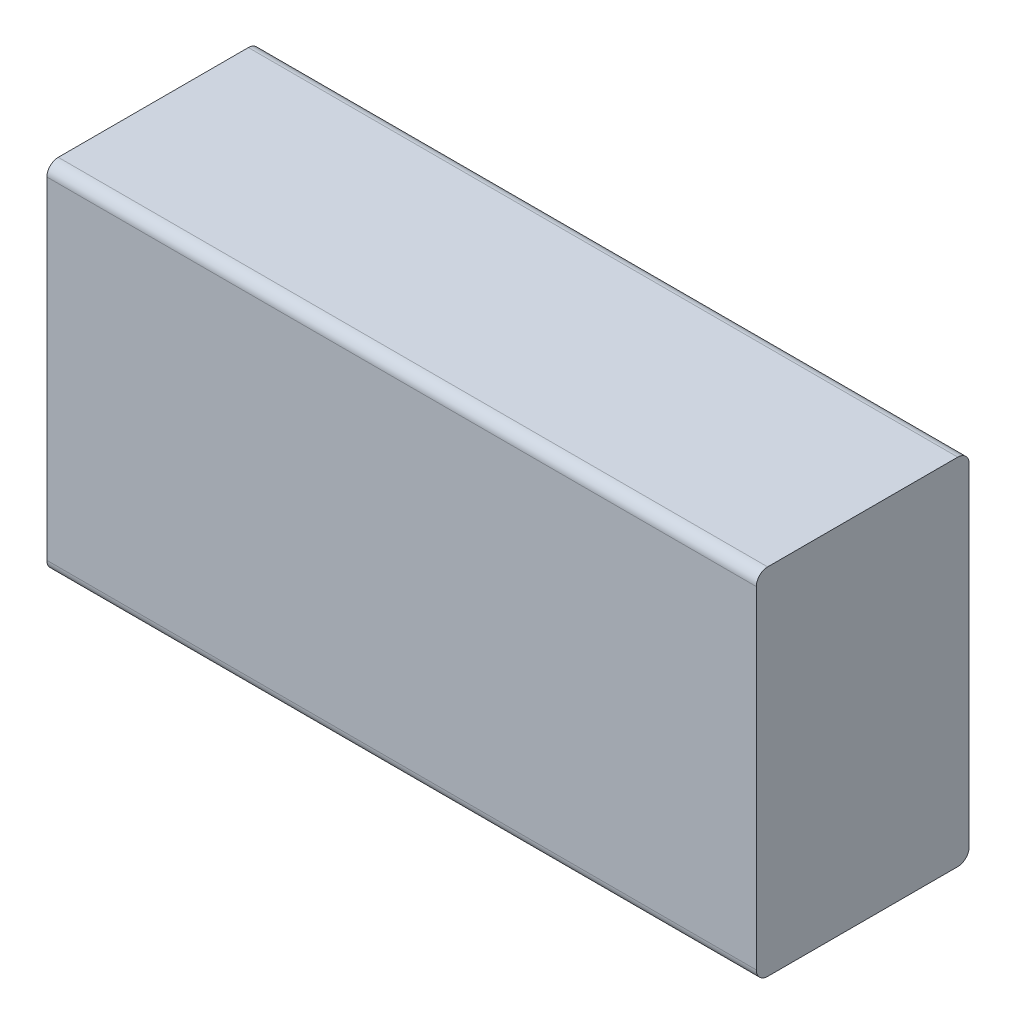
ISO-10303-21;
HEADER;
FILE_DESCRIPTION(('STEP AP214'),'2;1');
FILE_NAME('part.step','',(''),(''),'','','');
FILE_SCHEMA(('AUTOMOTIVE_DESIGN { 1 0 10303 214 1 1 1 1 }'));
ENDSEC;
DATA;
#1=APPLICATION_CONTEXT('core data for automotive mechanical design processes');
#2=APPLICATION_PROTOCOL_DEFINITION('international standard','automotive_design',2000,#1);
#3=PRODUCT_CONTEXT('',#1,'mechanical');
#4=PRODUCT('Part','Part','',(#3));
#5=PRODUCT_RELATED_PRODUCT_CATEGORY('part','',(#4));
#6=PRODUCT_DEFINITION_FORMATION('','',#4);
#7=PRODUCT_DEFINITION_CONTEXT('part definition',#1,'design');
#8=PRODUCT_DEFINITION('design','',#6,#7);
#9=PRODUCT_DEFINITION_SHAPE('','',#8);
#10=(LENGTH_UNIT() NAMED_UNIT(*) SI_UNIT(.MILLI.,.METRE.));
#11=(NAMED_UNIT(*) PLANE_ANGLE_UNIT() SI_UNIT($,.RADIAN.));
#12=(NAMED_UNIT(*) SI_UNIT($,.STERADIAN.) SOLID_ANGLE_UNIT());
#13=UNCERTAINTY_MEASURE_WITH_UNIT(LENGTH_MEASURE(1.E-05),#10,'distance_accuracy_value','');
#14=(GEOMETRIC_REPRESENTATION_CONTEXT(3) GLOBAL_UNCERTAINTY_ASSIGNED_CONTEXT((#13)) GLOBAL_UNIT_ASSIGNED_CONTEXT((#10,
#11,#12)) REPRESENTATION_CONTEXT('',''));
#15=CARTESIAN_POINT('',(0.,0.,0.));
#16=DIRECTION('',(0.,0.,1.));
#17=DIRECTION('',(1.,0.,0.));
#18=AXIS2_PLACEMENT_3D('',#15,#16,#17);
#19=CARTESIAN_POINT('',(0.,2.5,3.));
#20=DIRECTION('',(0.,-1.,0.));
#21=DIRECTION('',(1.,0.,0.));
#22=AXIS2_PLACEMENT_3D('',#19,#20,#21);
#23=PLANE('',#22);
#24=DIRECTION('',(0.,0.,-1.));
#25=VECTOR('',#24,1.);
#26=CARTESIAN_POINT('',(2.5,2.5,3.));
#27=LINE('',#26,#25);
#28=CARTESIAN_POINT('',(2.5,2.5,2.84));
#29=VERTEX_POINT('',#28);
#30=CARTESIAN_POINT('',(2.5,2.5,0.16));
#31=VERTEX_POINT('',#30);
#32=EDGE_CURVE('E121',#29,#31,#27,.T.);
#33=ORIENTED_EDGE('',*,*,#32,.T.);
#34=DIRECTION('',(-1.,0.,0.));
#35=VECTOR('',#34,1.);
#36=CARTESIAN_POINT('',(-7.5,2.5,0.16));
#37=LINE('',#36,#35);
#38=CARTESIAN_POINT('',(-7.5,2.5,0.16));
#39=VERTEX_POINT('',#38);
#40=EDGE_CURVE('E11',#31,#39,#37,.T.);
#41=ORIENTED_EDGE('',*,*,#40,.T.);
#42=DIRECTION('',(0.,0.,-1.));
#43=VECTOR('',#42,1.);
#44=CARTESIAN_POINT('',(-7.5,2.5,3.));
#45=LINE('',#44,#43);
#46=CARTESIAN_POINT('',(-7.5,2.5,2.84));
#47=VERTEX_POINT('',#46);
#48=EDGE_CURVE('E126',#47,#39,#45,.T.);
#49=ORIENTED_EDGE('',*,*,#48,.F.);
#50=DIRECTION('',(-1.,0.,0.));
#51=VECTOR('',#50,1.);
#52=CARTESIAN_POINT('',(0.,2.5,2.84));
#53=LINE('',#52,#51);
#54=EDGE_CURVE('E41',#47,#29,#53,.F.);
#55=ORIENTED_EDGE('',*,*,#54,.T.);
#56=EDGE_LOOP('',(#33,#41,#49,#55));
#57=FACE_BOUND('',#56,.T.);
#58=ADVANCED_FACE('F33',(#57),#23,.F.);
#59=CARTESIAN_POINT('',(-7.5,2.5,3.));
#60=DIRECTION('',(1.,0.,0.));
#61=DIRECTION('',(0.,1.,0.));
#62=AXIS2_PLACEMENT_3D('',#59,#60,#61);
#63=PLANE('',#62);
#64=DIRECTION('',(0.,-1.,0.));
#65=VECTOR('',#64,1.);
#66=CARTESIAN_POINT('',(-7.5,2.5,0.));
#67=LINE('',#66,#65);
#68=CARTESIAN_POINT('',(-7.5,2.34,0.));
#69=VERTEX_POINT('',#68);
#70=CARTESIAN_POINT('',(-7.5,-2.34,0.));
#71=VERTEX_POINT('',#70);
#72=EDGE_CURVE('E120',#69,#71,#67,.T.);
#73=ORIENTED_EDGE('',*,*,#72,.T.);
#74=CARTESIAN_POINT('',(-7.5,-2.34,0.16));
#75=DIRECTION('',(1.,0.,0.));
#76=DIRECTION('',(0.,1.,0.));
#77=AXIS2_PLACEMENT_3D('',#74,#75,#76);
#78=CIRCLE('',#77,0.16);
#79=CARTESIAN_POINT('',(-7.5,-2.5,0.16));
#80=VERTEX_POINT('',#79);
#81=EDGE_CURVE('E144',#71,#80,#78,.F.);
#82=ORIENTED_EDGE('',*,*,#81,.T.);
#83=DIRECTION('',(0.,0.,-1.));
#84=VECTOR('',#83,1.);
#85=CARTESIAN_POINT('',(-7.5,-2.5,3.));
#86=LINE('',#85,#84);
#87=CARTESIAN_POINT('',(-7.5,-2.5,2.84));
#88=VERTEX_POINT('',#87);
#89=EDGE_CURVE('E130',#88,#80,#86,.T.);
#90=ORIENTED_EDGE('',*,*,#89,.F.);
#91=CARTESIAN_POINT('',(-7.5,-2.34,2.84));
#92=DIRECTION('',(1.,0.,0.));
#93=DIRECTION('',(0.,1.,0.));
#94=AXIS2_PLACEMENT_3D('',#91,#92,#93);
#95=CIRCLE('',#94,0.16);
#96=CARTESIAN_POINT('',(-7.5,-2.34,3.));
#97=VERTEX_POINT('',#96);
#98=EDGE_CURVE('E125',#88,#97,#95,.F.);
#99=ORIENTED_EDGE('',*,*,#98,.T.);
#100=DIRECTION('',(0.,-1.,0.));
#101=VECTOR('',#100,1.);
#102=CARTESIAN_POINT('',(-7.5,2.5,3.));
#103=LINE('',#102,#101);
#104=CARTESIAN_POINT('',(-7.5,2.34,3.));
#105=VERTEX_POINT('',#104);
#106=EDGE_CURVE('E163',#105,#97,#103,.T.);
#107=ORIENTED_EDGE('',*,*,#106,.F.);
#108=CARTESIAN_POINT('',(-7.5,2.34,2.84));
#109=DIRECTION('',(1.,0.,0.));
#110=DIRECTION('',(0.,1.,0.));
#111=AXIS2_PLACEMENT_3D('',#108,#109,#110);
#112=CIRCLE('',#111,0.16);
#113=EDGE_CURVE('E55',#105,#47,#112,.F.);
#114=ORIENTED_EDGE('',*,*,#113,.T.);
#115=ORIENTED_EDGE('',*,*,#48,.T.);
#116=CARTESIAN_POINT('',(-7.5,2.34,0.16));
#117=DIRECTION('',(1.,0.,0.));
#118=DIRECTION('',(0.,1.,0.));
#119=AXIS2_PLACEMENT_3D('',#116,#117,#118);
#120=CIRCLE('',#119,0.16);
#121=EDGE_CURVE('E48',#39,#69,#120,.F.);
#122=ORIENTED_EDGE('',*,*,#121,.T.);
#123=EDGE_LOOP('',(#73,#82,#90,#99,#107,#114,#115,#122));
#124=FACE_BOUND('',#123,.T.);
#125=ADVANCED_FACE('F165',(#124),#63,.F.);
#126=CARTESIAN_POINT('',(-7.5,-2.5,3.));
#127=DIRECTION('',(0.,1.,0.));
#128=DIRECTION('',(-1.,0.,0.));
#129=AXIS2_PLACEMENT_3D('',#126,#127,#128);
#130=PLANE('',#129);
#131=ORIENTED_EDGE('',*,*,#89,.T.);
#132=DIRECTION('',(1.,0.,0.));
#133=VECTOR('',#132,1.);
#134=CARTESIAN_POINT('',(2.5,-2.5,0.16));
#135=LINE('',#134,#133);
#136=CARTESIAN_POINT('',(2.5,-2.5,0.16));
#137=VERTEX_POINT('',#136);
#138=EDGE_CURVE('E119',#80,#137,#135,.T.);
#139=ORIENTED_EDGE('',*,*,#138,.T.);
#140=DIRECTION('',(0.,0.,-1.));
#141=VECTOR('',#140,1.);
#142=CARTESIAN_POINT('',(2.5,-2.5,3.));
#143=LINE('',#142,#141);
#144=CARTESIAN_POINT('',(2.5,-2.5,2.84));
#145=VERTEX_POINT('',#144);
#146=EDGE_CURVE('E102',#145,#137,#143,.T.);
#147=ORIENTED_EDGE('',*,*,#146,.F.);
#148=DIRECTION('',(1.,0.,0.));
#149=VECTOR('',#148,1.);
#150=CARTESIAN_POINT('',(-7.5,-2.5,2.84));
#151=LINE('',#150,#149);
#152=EDGE_CURVE('E116',#145,#88,#151,.F.);
#153=ORIENTED_EDGE('',*,*,#152,.T.);
#154=EDGE_LOOP('',(#131,#139,#147,#153));
#155=FACE_BOUND('',#154,.T.);
#156=ADVANCED_FACE('F115',(#155),#130,.F.);
#157=CARTESIAN_POINT('',(0.,0.,3.));
#158=DIRECTION('',(0.,0.,-1.));
#159=DIRECTION('',(-1.,0.,0.));
#160=AXIS2_PLACEMENT_3D('',#157,#158,#159);
#161=PLANE('',#160);
#162=ORIENTED_EDGE('',*,*,#106,.T.);
#163=DIRECTION('',(1.,0.,0.));
#164=VECTOR('',#163,1.);
#165=CARTESIAN_POINT('',(0.,-2.34,3.));
#166=LINE('',#165,#164);
#167=CARTESIAN_POINT('',(2.5,-2.34,3.));
#168=VERTEX_POINT('',#167);
#169=EDGE_CURVE('E149',#97,#168,#166,.T.);
#170=ORIENTED_EDGE('',*,*,#169,.T.);
#171=DIRECTION('',(0.,1.,0.));
#172=VECTOR('',#171,1.);
#173=CARTESIAN_POINT('',(2.5,2.5,3.));
#174=LINE('',#173,#172);
#175=CARTESIAN_POINT('',(2.5,2.34,3.));
#176=VERTEX_POINT('',#175);
#177=EDGE_CURVE('E104',#168,#176,#174,.T.);
#178=ORIENTED_EDGE('',*,*,#177,.T.);
#179=DIRECTION('',(-1.,0.,0.));
#180=VECTOR('',#179,1.);
#181=CARTESIAN_POINT('',(0.,2.34,3.));
#182=LINE('',#181,#180);
#183=EDGE_CURVE('E146',#176,#105,#182,.T.);
#184=ORIENTED_EDGE('',*,*,#183,.T.);
#185=EDGE_LOOP('',(#162,#170,#178,#184));
#186=FACE_BOUND('',#185,.T.);
#187=ADVANCED_FACE('F162',(#186),#161,.F.);
#188=CARTESIAN_POINT('',(0.,0.,0.));
#189=DIRECTION('',(0.,0.,-1.));
#190=DIRECTION('',(-1.,0.,0.));
#191=AXIS2_PLACEMENT_3D('',#188,#189,#190);
#192=PLANE('',#191);
#193=DIRECTION('',(0.,1.,0.));
#194=VECTOR('',#193,1.);
#195=CARTESIAN_POINT('',(2.5,2.5,0.));
#196=LINE('',#195,#194);
#197=CARTESIAN_POINT('',(2.5,-2.34,0.));
#198=VERTEX_POINT('',#197);
#199=CARTESIAN_POINT('',(2.5,2.34,0.));
#200=VERTEX_POINT('',#199);
#201=EDGE_CURVE('E169',#198,#200,#196,.T.);
#202=ORIENTED_EDGE('',*,*,#201,.F.);
#203=DIRECTION('',(1.,0.,0.));
#204=VECTOR('',#203,1.);
#205=CARTESIAN_POINT('',(-7.5,-2.34,0.));
#206=LINE('',#205,#204);
#207=EDGE_CURVE('E139',#198,#71,#206,.F.);
#208=ORIENTED_EDGE('',*,*,#207,.T.);
#209=ORIENTED_EDGE('',*,*,#72,.F.);
#210=DIRECTION('',(-1.,0.,0.));
#211=VECTOR('',#210,1.);
#212=CARTESIAN_POINT('',(2.5,2.34,0.));
#213=LINE('',#212,#211);
#214=EDGE_CURVE('E137',#69,#200,#213,.F.);
#215=ORIENTED_EDGE('',*,*,#214,.T.);
#216=EDGE_LOOP('',(#202,#208,#209,#215));
#217=FACE_BOUND('',#216,.T.);
#218=ADVANCED_FACE('F177',(#217),#192,.T.);
#219=CARTESIAN_POINT('',(2.5,2.5,3.));
#220=DIRECTION('',(-1.,0.,0.));
#221=DIRECTION('',(0.,-1.,0.));
#222=AXIS2_PLACEMENT_3D('',#219,#220,#221);
#223=PLANE('',#222);
#224=ORIENTED_EDGE('',*,*,#146,.T.);
#225=CARTESIAN_POINT('',(2.5,-2.34,0.16));
#226=DIRECTION('',(-1.,0.,0.));
#227=DIRECTION('',(0.,-1.,0.));
#228=AXIS2_PLACEMENT_3D('',#225,#226,#227);
#229=CIRCLE('',#228,0.16);
#230=EDGE_CURVE('E109',#137,#198,#229,.F.);
#231=ORIENTED_EDGE('',*,*,#230,.T.);
#232=ORIENTED_EDGE('',*,*,#201,.T.);
#233=CARTESIAN_POINT('',(2.5,2.34,0.16));
#234=DIRECTION('',(-1.,0.,0.));
#235=DIRECTION('',(0.,-1.,0.));
#236=AXIS2_PLACEMENT_3D('',#233,#234,#235);
#237=CIRCLE('',#236,0.16);
#238=EDGE_CURVE('E110',#200,#31,#237,.F.);
#239=ORIENTED_EDGE('',*,*,#238,.T.);
#240=ORIENTED_EDGE('',*,*,#32,.F.);
#241=CARTESIAN_POINT('',(2.5,2.34,2.84));
#242=DIRECTION('',(-1.,0.,0.));
#243=DIRECTION('',(0.,-1.,0.));
#244=AXIS2_PLACEMENT_3D('',#241,#242,#243);
#245=CIRCLE('',#244,0.16);
#246=EDGE_CURVE('E128',#29,#176,#245,.F.);
#247=ORIENTED_EDGE('',*,*,#246,.T.);
#248=ORIENTED_EDGE('',*,*,#177,.F.);
#249=CARTESIAN_POINT('',(2.5,-2.34,2.84));
#250=DIRECTION('',(-1.,0.,0.));
#251=DIRECTION('',(0.,-1.,0.));
#252=AXIS2_PLACEMENT_3D('',#249,#250,#251);
#253=CIRCLE('',#252,0.16);
#254=EDGE_CURVE('E99',#168,#145,#253,.F.);
#255=ORIENTED_EDGE('',*,*,#254,.T.);
#256=EDGE_LOOP('',(#224,#231,#232,#239,#240,#247,#248,#255));
#257=FACE_BOUND('',#256,.T.);
#258=ADVANCED_FACE('F101',(#257),#223,.F.);
#259=CARTESIAN_POINT('',(-7.5,-2.34,0.16));
#260=DIRECTION('',(-1.,0.,0.));
#261=DIRECTION('',(0.,-1.,0.));
#262=AXIS2_PLACEMENT_3D('',#259,#260,#261);
#263=CYLINDRICAL_SURFACE('',#262,0.16);
#264=ORIENTED_EDGE('',*,*,#81,.F.);
#265=ORIENTED_EDGE('',*,*,#207,.F.);
#266=ORIENTED_EDGE('',*,*,#230,.F.);
#267=ORIENTED_EDGE('',*,*,#138,.F.);
#268=EDGE_LOOP('',(#264,#265,#266,#267));
#269=FACE_BOUND('',#268,.T.);
#270=ADVANCED_FACE('F179',(#269),#263,.T.);
#271=CARTESIAN_POINT('',(0.,-2.34,2.84));
#272=DIRECTION('',(1.,0.,0.));
#273=DIRECTION('',(0.,1.,0.));
#274=AXIS2_PLACEMENT_3D('',#271,#272,#273);
#275=CYLINDRICAL_SURFACE('',#274,0.16);
#276=ORIENTED_EDGE('',*,*,#98,.F.);
#277=ORIENTED_EDGE('',*,*,#152,.F.);
#278=ORIENTED_EDGE('',*,*,#254,.F.);
#279=ORIENTED_EDGE('',*,*,#169,.F.);
#280=EDGE_LOOP('',(#276,#277,#278,#279));
#281=FACE_BOUND('',#280,.T.);
#282=ADVANCED_FACE('F124',(#281),#275,.T.);
#283=CARTESIAN_POINT('',(0.,2.34,0.16));
#284=DIRECTION('',(1.,0.,0.));
#285=DIRECTION('',(0.,1.,0.));
#286=AXIS2_PLACEMENT_3D('',#283,#284,#285);
#287=CYLINDRICAL_SURFACE('',#286,0.16);
#288=ORIENTED_EDGE('',*,*,#238,.F.);
#289=ORIENTED_EDGE('',*,*,#214,.F.);
#290=ORIENTED_EDGE('',*,*,#121,.F.);
#291=ORIENTED_EDGE('',*,*,#40,.F.);
#292=EDGE_LOOP('',(#288,#289,#290,#291));
#293=FACE_BOUND('',#292,.T.);
#294=ADVANCED_FACE('F174',(#293),#287,.T.);
#295=CARTESIAN_POINT('',(0.,2.34,2.84));
#296=DIRECTION('',(-1.,0.,0.));
#297=DIRECTION('',(0.,-1.,0.));
#298=AXIS2_PLACEMENT_3D('',#295,#296,#297);
#299=CYLINDRICAL_SURFACE('',#298,0.16);
#300=ORIENTED_EDGE('',*,*,#246,.F.);
#301=ORIENTED_EDGE('',*,*,#54,.F.);
#302=ORIENTED_EDGE('',*,*,#113,.F.);
#303=ORIENTED_EDGE('',*,*,#183,.F.);
#304=EDGE_LOOP('',(#300,#301,#302,#303));
#305=FACE_BOUND('',#304,.T.);
#306=ADVANCED_FACE('F35',(#305),#299,.T.);
#307=CLOSED_SHELL('',(#58,#125,#156,#187,#218,#258,#270,#282,#294,#306));
#308=MANIFOLD_SOLID_BREP('B2',#307);
#309=ADVANCED_BREP_SHAPE_REPRESENTATION('',(#18,#308),#14);
#310=SHAPE_DEFINITION_REPRESENTATION(#9,#309);
ENDSEC;
END-ISO-10303-21;
